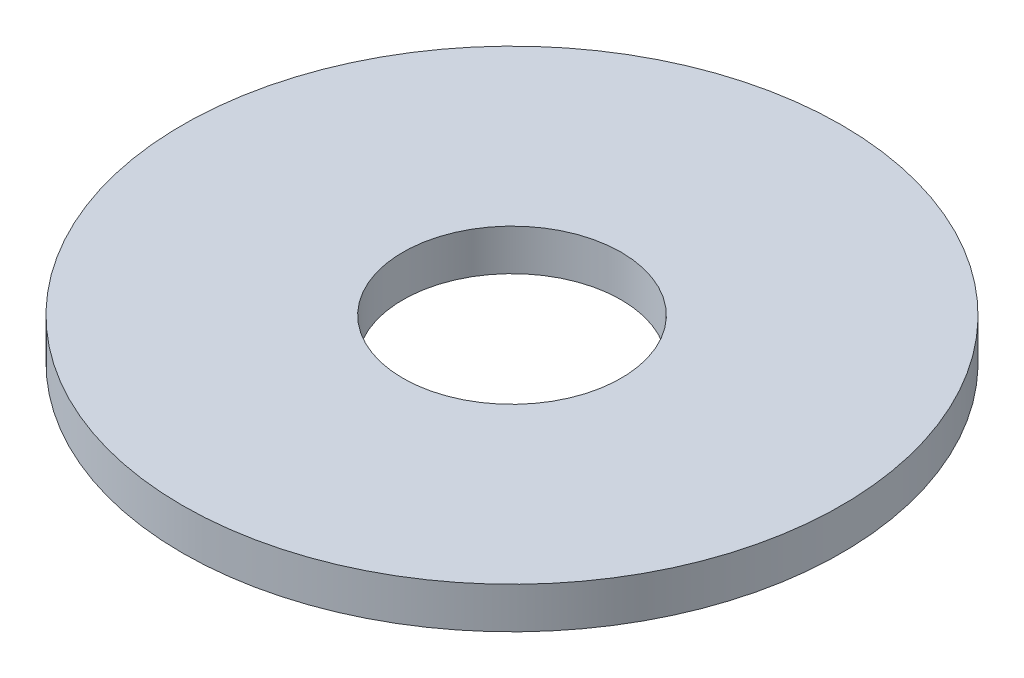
ISO-10303-21;
HEADER;
FILE_DESCRIPTION(('STEP AP214'),'2;1');
FILE_NAME('part.step','',(''),(''),'','','');
FILE_SCHEMA(('AUTOMOTIVE_DESIGN { 1 0 10303 214 1 1 1 1 }'));
ENDSEC;
DATA;
#1=APPLICATION_CONTEXT('core data for automotive mechanical design processes');
#2=APPLICATION_PROTOCOL_DEFINITION('international standard','automotive_design',2000,#1);
#3=PRODUCT_CONTEXT('',#1,'mechanical');
#4=PRODUCT('Part','Part','',(#3));
#5=PRODUCT_RELATED_PRODUCT_CATEGORY('part','',(#4));
#6=PRODUCT_DEFINITION_FORMATION('','',#4);
#7=PRODUCT_DEFINITION_CONTEXT('part definition',#1,'design');
#8=PRODUCT_DEFINITION('design','',#6,#7);
#9=PRODUCT_DEFINITION_SHAPE('','',#8);
#10=(LENGTH_UNIT() NAMED_UNIT(*) SI_UNIT(.MILLI.,.METRE.));
#11=(NAMED_UNIT(*) PLANE_ANGLE_UNIT() SI_UNIT($,.RADIAN.));
#12=(NAMED_UNIT(*) SI_UNIT($,.STERADIAN.) SOLID_ANGLE_UNIT());
#13=UNCERTAINTY_MEASURE_WITH_UNIT(LENGTH_MEASURE(1.E-05),#10,'distance_accuracy_value','');
#14=(GEOMETRIC_REPRESENTATION_CONTEXT(3) GLOBAL_UNCERTAINTY_ASSIGNED_CONTEXT((#13)) GLOBAL_UNIT_ASSIGNED_CONTEXT((#10,
#11,#12)) REPRESENTATION_CONTEXT('',''));
#15=CARTESIAN_POINT('',(0.,0.,0.));
#16=DIRECTION('',(0.,0.,1.));
#17=DIRECTION('',(1.,0.,0.));
#18=AXIS2_PLACEMENT_3D('',#15,#16,#17);
#19=CARTESIAN_POINT('',(0.,0.,0.));
#20=DIRECTION('',(0.,-1.,0.));
#21=DIRECTION('',(0.,0.,-1.));
#22=AXIS2_PLACEMENT_3D('',#19,#20,#21);
#23=CYLINDRICAL_SURFACE('',#22,8.);
#24=CARTESIAN_POINT('',(0.,1.,0.));
#25=DIRECTION('',(0.,-1.,0.));
#26=DIRECTION('',(0.,0.,-1.));
#27=AXIS2_PLACEMENT_3D('',#24,#25,#26);
#28=CIRCLE('',#27,8.);
#29=CARTESIAN_POINT('',(0.,1.,-8.));
#30=VERTEX_POINT('',#29);
#31=EDGE_CURVE('E10',#30,#30,#28,.T.);
#32=ORIENTED_EDGE('',*,*,#31,.T.);
#33=EDGE_LOOP('',(#32));
#34=FACE_BOUND('',#33,.T.);
#35=CARTESIAN_POINT('',(0.,0.,0.));
#36=DIRECTION('',(0.,-1.,0.));
#37=DIRECTION('',(0.,0.,-1.));
#38=AXIS2_PLACEMENT_3D('',#35,#36,#37);
#39=CIRCLE('',#38,8.);
#40=CARTESIAN_POINT('',(0.,0.,-8.));
#41=VERTEX_POINT('',#40);
#42=EDGE_CURVE('E45',#41,#41,#39,.T.);
#43=ORIENTED_EDGE('',*,*,#42,.F.);
#44=EDGE_LOOP('',(#43));
#45=FACE_BOUND('',#44,.T.);
#46=ADVANCED_FACE('F31',(#34,#45),#23,.T.);
#47=CARTESIAN_POINT('',(8.,1.,0.));
#48=DIRECTION('',(0.,1.,0.));
#49=DIRECTION('',(0.,0.,1.));
#50=AXIS2_PLACEMENT_3D('',#47,#48,#49);
#51=PLANE('',#50);
#52=CARTESIAN_POINT('',(0.,0.999999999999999,0.));
#53=DIRECTION('',(0.,-1.,0.));
#54=DIRECTION('',(0.,0.,-1.));
#55=AXIS2_PLACEMENT_3D('',#52,#53,#54);
#56=CIRCLE('',#55,2.65);
#57=CARTESIAN_POINT('',(0.,0.999999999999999,-2.65));
#58=VERTEX_POINT('',#57);
#59=EDGE_CURVE('E37',#58,#58,#56,.T.);
#60=ORIENTED_EDGE('',*,*,#59,.T.);
#61=EDGE_LOOP('',(#60));
#62=FACE_BOUND('',#61,.T.);
#63=ORIENTED_EDGE('',*,*,#31,.F.);
#64=EDGE_LOOP('',(#63));
#65=FACE_BOUND('',#64,.T.);
#66=ADVANCED_FACE('F55',(#62,#65),#51,.T.);
#67=CARTESIAN_POINT('',(0.,0.,0.));
#68=DIRECTION('',(0.,-1.,0.));
#69=DIRECTION('',(0.,0.,-1.));
#70=AXIS2_PLACEMENT_3D('',#67,#68,#69);
#71=CYLINDRICAL_SURFACE('',#70,2.65);
#72=CARTESIAN_POINT('',(0.,0.,0.));
#73=DIRECTION('',(0.,-1.,0.));
#74=DIRECTION('',(0.,0.,-1.));
#75=AXIS2_PLACEMENT_3D('',#72,#73,#74);
#76=CIRCLE('',#75,2.65);
#77=CARTESIAN_POINT('',(0.,0.,-2.65));
#78=VERTEX_POINT('',#77);
#79=EDGE_CURVE('E41',#78,#78,#76,.T.);
#80=ORIENTED_EDGE('',*,*,#79,.T.);
#81=EDGE_LOOP('',(#80));
#82=FACE_BOUND('',#81,.T.);
#83=ORIENTED_EDGE('',*,*,#59,.F.);
#84=EDGE_LOOP('',(#83));
#85=FACE_BOUND('',#84,.T.);
#86=ADVANCED_FACE('F59',(#82,#85),#71,.F.);
#87=CARTESIAN_POINT('',(2.65,0.,0.));
#88=DIRECTION('',(0.,-1.,0.));
#89=DIRECTION('',(0.,0.,-1.));
#90=AXIS2_PLACEMENT_3D('',#87,#88,#89);
#91=PLANE('',#90);
#92=ORIENTED_EDGE('',*,*,#42,.T.);
#93=EDGE_LOOP('',(#92));
#94=FACE_BOUND('',#93,.T.);
#95=ORIENTED_EDGE('',*,*,#79,.F.);
#96=EDGE_LOOP('',(#95));
#97=FACE_BOUND('',#96,.T.);
#98=ADVANCED_FACE('F51',(#94,#97),#91,.T.);
#99=CLOSED_SHELL('',(#46,#66,#86,#98));
#100=MANIFOLD_SOLID_BREP('B2',#99);
#101=ADVANCED_BREP_SHAPE_REPRESENTATION('',(#18,#100),#14);
#102=SHAPE_DEFINITION_REPRESENTATION(#9,#101);
ENDSEC;
END-ISO-10303-21;
